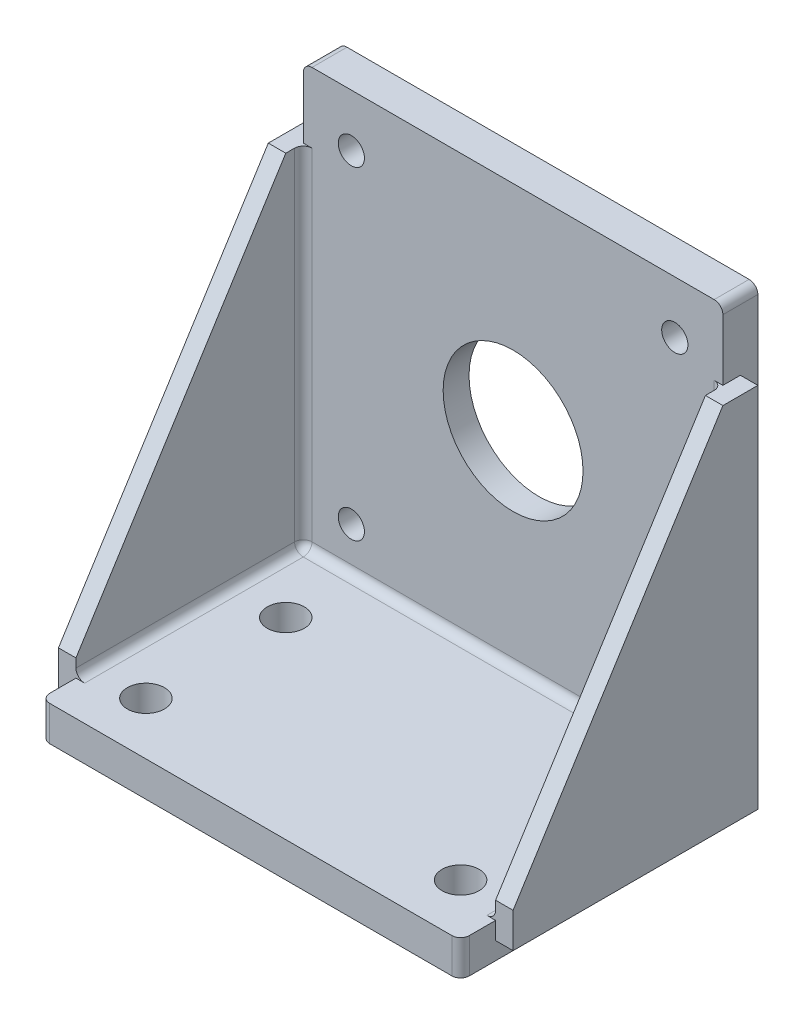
from build123d import *

# Parameters (mm, degrees)
SKETCH1_W            = 152.4
SKETCH1_H            = 152.4
SKETCH1_R            = 4.7625
BASE_EXTRUDE_DEPTH   = 12.7
SKETCH2_W            = 101.6
SKETCH2_H            = 12.7
BOSS_EXTRUDE1_DEPTH  = 152.4
BOSS_EXTRUDE2_DEPTH  = 6.35
SKETCH4_R            = 6.7437
CUT_EXTRUDE1_DEPTH   = 205.189776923
LPATTERN1_COUNT      = 2
LPATTERN1_PITCH      = 114.3
LPATTERN1_COUNT_DIR2 = 2
LPATTERN1_PITCH_DIR2 = 50.8
SKETCH5_R            = 63.5635
PILOT_BORE_DEPTH     = 3.302
SKETCH6_R            = 25.4
CUT_EXTRUDE3_DEPTH   = 160.339822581
FILLET1_R            = 3.175
FILLET2_R            = 3.175


with BuildPart() as part:
    # Sketch1 → Base-Extrude (new body)
    with BuildSketch(Plane.XY):
        with Locations((0, 1.5875)):
            Rectangle(SKETCH1_W, SKETCH1_H)
        with Locations((58.7375, 58.7375)):
            Circle(SKETCH1_R, mode=Mode.SUBTRACT)
        with Locations((-58.7375, 58.7375)):
            Circle(SKETCH1_R, mode=Mode.SUBTRACT)
        with Locations((58.7375, -58.7375)):
            Circle(SKETCH1_R, mode=Mode.SUBTRACT)
        with Locations((-58.7375, -58.7375)):
            Circle(SKETCH1_R, mode=Mode.SUBTRACT)
    extrude(amount=BASE_EXTRUDE_DEPTH)

    # Sketch2 → Boss-Extrude1 (add)
    with BuildSketch(Plane(origin=(76.2, 0, 0), x_dir=(0, 0, -1), z_dir=(1, 0, 0))):
        with Locations((-57.15, -80.9625)):
            Rectangle(SKETCH2_W, SKETCH2_H)
    extrude(amount=-BOSS_EXTRUDE1_DEPTH)

    # Sketch3 → Boss-Extrude2 (add)
    with BuildSketch(Plane(origin=(76.2, 0, 0), x_dir=(0, 0, -1), z_dir=(1, 0, 0))):
        Polygon((-6.35, -80.9625), (-6.35, 52.3875), (-19.05, 52.3875), (-95.25, -68.2625), (-95.25, -80.9625), align=None)
    boss_extrude2 = extrude(amount=BOSS_EXTRUDE2_DEPTH)

    # Mirror1: Boss-Extrude2 across plane
    add(boss_extrude2.mirror(Plane(origin=(0, 0, 0), x_dir=(0, 0, 1), z_dir=(1, 0, 0))))

    # Sketch4 → Cut-Extrude1 (cut, through all)
    with BuildSketch(Plane(origin=(0, -74.6125, 0), x_dir=(-1, 0, 0), z_dir=(0, 1, 0))):
        with Locations(Location((57.15, 88.9, 0), (0, 0, 90))):
            Circle(SKETCH4_R)
    cut_extrude1 = extrude(amount=-CUT_EXTRUDE1_DEPTH, mode=Mode.SUBTRACT)

    # LPattern1: Cut-Extrude1 2 × 2
    with Locations(*[(i * LPATTERN1_PITCH, 0, -j * LPATTERN1_PITCH_DIR2) for i in range(LPATTERN1_COUNT) for j in range(LPATTERN1_COUNT_DIR2) if (i, j) != (0, 0)]):
        add(cut_extrude1, mode=Mode.SUBTRACT)

    # Sketch5 → pilot bore (cut)
    with BuildSketch(Plane(origin=(0, 0, 0), x_dir=(-1, 0, 0), z_dir=(0, 0, -1))):
        Circle(SKETCH5_R)
    extrude(amount=-PILOT_BORE_DEPTH, mode=Mode.SUBTRACT)

    # Sketch6 → Cut-Extrude3 (cut, through all)
    with BuildSketch(Plane(origin=(0, 0, 3.302), x_dir=(-1, 0, 0), z_dir=(0, 0, -1))):
        Circle(SKETCH6_R)
    extrude(amount=-CUT_EXTRUDE3_DEPTH, mode=Mode.SUBTRACT)

    # Fillet1
    fillet1_edges = [part.edges().sort_by_distance(p)[0] for p in [
        (0, -74.6125, 12.7),
    ]]
    fillet(fillet1_edges, radius=FILLET1_R)

    # Fillet2
    fillet2_edges = [part.edges().sort_by_distance(p)[0] for p in [
        (76.2, -74.6125, 55.5625),
        (-76.2, -74.6125, 55.5625),
        (76.2, -9.525, 12.7),
        (76.2, -80.9625, 107.95),
        (-76.2, -80.9625, 107.95),
        (-76.2, -9.525, 12.7),
        (76.2, 77.7875, 6.35),
        (-76.2, 77.7875, 6.35),
        (-76.2, -73.68256403, 13.62993597),
        (76.2, -73.68256403, 13.62993597),
    ]]
    fillet(fillet2_edges, radius=FILLET2_R)


solid = part.part
